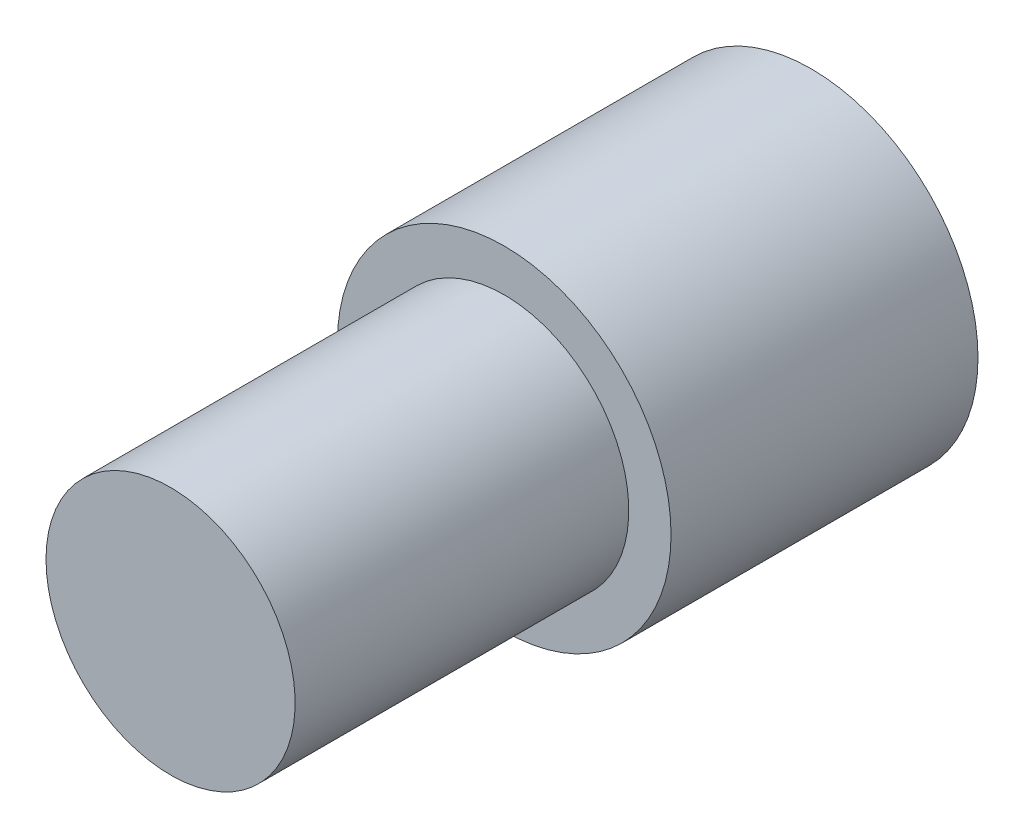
ISO-10303-21;
HEADER;
FILE_DESCRIPTION(('STEP AP214'),'2;1');
FILE_NAME('part.step','',(''),(''),'','','');
FILE_SCHEMA(('AUTOMOTIVE_DESIGN { 1 0 10303 214 1 1 1 1 }'));
ENDSEC;
DATA;
#1=APPLICATION_CONTEXT('core data for automotive mechanical design processes');
#2=APPLICATION_PROTOCOL_DEFINITION('international standard','automotive_design',2000,#1);
#3=PRODUCT_CONTEXT('',#1,'mechanical');
#4=PRODUCT('Part','Part','',(#3));
#5=PRODUCT_RELATED_PRODUCT_CATEGORY('part','',(#4));
#6=PRODUCT_DEFINITION_FORMATION('','',#4);
#7=PRODUCT_DEFINITION_CONTEXT('part definition',#1,'design');
#8=PRODUCT_DEFINITION('design','',#6,#7);
#9=PRODUCT_DEFINITION_SHAPE('','',#8);
#10=(LENGTH_UNIT() NAMED_UNIT(*) SI_UNIT(.MILLI.,.METRE.));
#11=(NAMED_UNIT(*) PLANE_ANGLE_UNIT() SI_UNIT($,.RADIAN.));
#12=(NAMED_UNIT(*) SI_UNIT($,.STERADIAN.) SOLID_ANGLE_UNIT());
#13=UNCERTAINTY_MEASURE_WITH_UNIT(LENGTH_MEASURE(1.E-05),#10,'distance_accuracy_value','');
#14=(GEOMETRIC_REPRESENTATION_CONTEXT(3) GLOBAL_UNCERTAINTY_ASSIGNED_CONTEXT((#13)) GLOBAL_UNIT_ASSIGNED_CONTEXT((#10,
#11,#12)) REPRESENTATION_CONTEXT('',''));
#15=CARTESIAN_POINT('',(0.,0.,0.));
#16=DIRECTION('',(0.,0.,1.));
#17=DIRECTION('',(1.,0.,0.));
#18=AXIS2_PLACEMENT_3D('',#15,#16,#17);
#19=CARTESIAN_POINT('',(0.,0.,17.526));
#20=DIRECTION('',(0.,0.,-1.));
#21=DIRECTION('',(-1.,0.,0.));
#22=AXIS2_PLACEMENT_3D('',#19,#20,#21);
#23=CYLINDRICAL_SURFACE('',#22,9.525);
#24=CARTESIAN_POINT('',(0.,0.,17.526));
#25=DIRECTION('',(0.,0.,1.));
#26=DIRECTION('',(1.,0.,0.));
#27=AXIS2_PLACEMENT_3D('',#24,#25,#26);
#28=CIRCLE('',#27,9.525);
#29=CARTESIAN_POINT('',(9.525,0.,17.526));
#30=VERTEX_POINT('',#29);
#31=EDGE_CURVE('E10',#30,#30,#28,.T.);
#32=ORIENTED_EDGE('',*,*,#31,.F.);
#33=EDGE_LOOP('',(#32));
#34=FACE_BOUND('',#33,.T.);
#35=CARTESIAN_POINT('',(0.,0.,0.));
#36=DIRECTION('',(0.,0.,1.));
#37=DIRECTION('',(1.,0.,0.));
#38=AXIS2_PLACEMENT_3D('',#35,#36,#37);
#39=CIRCLE('',#38,9.525);
#40=CARTESIAN_POINT('',(9.525,0.,0.));
#41=VERTEX_POINT('',#40);
#42=EDGE_CURVE('E33',#41,#41,#39,.T.);
#43=ORIENTED_EDGE('',*,*,#42,.T.);
#44=EDGE_LOOP('',(#43));
#45=FACE_BOUND('',#44,.T.);
#46=ADVANCED_FACE('F30',(#34,#45),#23,.T.);
#47=CARTESIAN_POINT('',(0.,0.,17.526));
#48=DIRECTION('',(0.,0.,1.));
#49=DIRECTION('',(1.,0.,0.));
#50=AXIS2_PLACEMENT_3D('',#47,#48,#49);
#51=PLANE('',#50);
#52=CARTESIAN_POINT('',(0.,0.,17.526));
#53=DIRECTION('',(0.,0.,1.));
#54=DIRECTION('',(1.,0.,0.));
#55=AXIS2_PLACEMENT_3D('',#52,#53,#54);
#56=CIRCLE('',#55,7.112);
#57=CARTESIAN_POINT('',(-7.112,0.,17.526));
#58=VERTEX_POINT('',#57);
#59=EDGE_CURVE('E42',#58,#58,#56,.T.);
#60=ORIENTED_EDGE('',*,*,#59,.F.);
#61=EDGE_LOOP('',(#60));
#62=FACE_BOUND('',#61,.T.);
#63=ORIENTED_EDGE('',*,*,#31,.T.);
#64=EDGE_LOOP('',(#63));
#65=FACE_BOUND('',#64,.T.);
#66=ADVANCED_FACE('F57',(#62,#65),#51,.T.);
#67=CARTESIAN_POINT('',(0.,0.,0.));
#68=DIRECTION('',(0.,0.,1.));
#69=DIRECTION('',(1.,0.,0.));
#70=AXIS2_PLACEMENT_3D('',#67,#68,#69);
#71=PLANE('',#70);
#72=ORIENTED_EDGE('',*,*,#42,.F.);
#73=EDGE_LOOP('',(#72));
#74=FACE_BOUND('',#73,.T.);
#75=ADVANCED_FACE('F53',(#74),#71,.F.);
#76=CARTESIAN_POINT('',(0.,0.,36.576));
#77=DIRECTION('',(0.,0.,-1.));
#78=DIRECTION('',(-1.,0.,0.));
#79=AXIS2_PLACEMENT_3D('',#76,#77,#78);
#80=CYLINDRICAL_SURFACE('',#79,7.112);
#81=CARTESIAN_POINT('',(0.,0.,36.576));
#82=DIRECTION('',(0.,0.,1.));
#83=DIRECTION('',(1.,0.,0.));
#84=AXIS2_PLACEMENT_3D('',#81,#82,#83);
#85=CIRCLE('',#84,7.112);
#86=CARTESIAN_POINT('',(-7.112,0.,36.576));
#87=VERTEX_POINT('',#86);
#88=EDGE_CURVE('E40',#87,#87,#85,.T.);
#89=CARTESIAN_POINT('',(-7.112,0.,36.576));
#90=CARTESIAN_POINT('',(-7.112,0.,36.3775625));
#91=CARTESIAN_POINT('',(-7.112,0.,36.179125));
#92=CARTESIAN_POINT('',(-7.112,0.,35.78225));
#93=CARTESIAN_POINT('',(-7.112,0.,35.5838125));
#94=CARTESIAN_POINT('',(-7.112,0.,35.1869375));
#95=CARTESIAN_POINT('',(-7.112,0.,34.9885));
#96=CARTESIAN_POINT('',(-7.112,0.,34.591625));
#97=CARTESIAN_POINT('',(-7.112,0.,34.3931875));
#98=CARTESIAN_POINT('',(-7.112,0.,33.9963125));
#99=CARTESIAN_POINT('',(-7.112,0.,33.797875));
#100=CARTESIAN_POINT('',(-7.112,0.,33.401));
#101=CARTESIAN_POINT('',(-7.112,0.,33.2025625));
#102=CARTESIAN_POINT('',(-7.112,0.,32.8056875));
#103=CARTESIAN_POINT('',(-7.112,0.,32.60725));
#104=CARTESIAN_POINT('',(-7.112,0.,32.210375));
#105=CARTESIAN_POINT('',(-7.112,0.,32.0119375));
#106=CARTESIAN_POINT('',(-7.112,0.,31.6150625));
#107=CARTESIAN_POINT('',(-7.112,0.,31.416625));
#108=CARTESIAN_POINT('',(-7.112,0.,31.01975));
#109=CARTESIAN_POINT('',(-7.112,0.,30.8213125));
#110=CARTESIAN_POINT('',(-7.112,0.,30.4244375));
#111=CARTESIAN_POINT('',(-7.112,0.,30.226));
#112=CARTESIAN_POINT('',(-7.112,0.,29.829125));
#113=CARTESIAN_POINT('',(-7.112,0.,29.6306875));
#114=CARTESIAN_POINT('',(-7.112,0.,29.2338125));
#115=CARTESIAN_POINT('',(-7.112,0.,29.035375));
#116=CARTESIAN_POINT('',(-7.112,0.,28.6385));
#117=CARTESIAN_POINT('',(-7.112,0.,28.4400625));
#118=CARTESIAN_POINT('',(-7.112,0.,28.0431875));
#119=CARTESIAN_POINT('',(-7.112,0.,27.84475));
#120=CARTESIAN_POINT('',(-7.112,0.,27.447875));
#121=CARTESIAN_POINT('',(-7.112,0.,27.2494375));
#122=CARTESIAN_POINT('',(-7.112,0.,26.8525625));
#123=CARTESIAN_POINT('',(-7.112,0.,26.654125));
#124=CARTESIAN_POINT('',(-7.112,0.,26.25725));
#125=CARTESIAN_POINT('',(-7.112,0.,26.0588125));
#126=CARTESIAN_POINT('',(-7.112,0.,25.6619375));
#127=CARTESIAN_POINT('',(-7.112,0.,25.4635));
#128=CARTESIAN_POINT('',(-7.112,0.,25.066625));
#129=CARTESIAN_POINT('',(-7.112,0.,24.8681875));
#130=CARTESIAN_POINT('',(-7.112,0.,24.4713125));
#131=CARTESIAN_POINT('',(-7.112,0.,24.272875));
#132=CARTESIAN_POINT('',(-7.112,0.,23.876));
#133=CARTESIAN_POINT('',(-7.112,0.,23.6775625));
#134=CARTESIAN_POINT('',(-7.112,0.,23.2806875));
#135=CARTESIAN_POINT('',(-7.112,0.,23.08225));
#136=CARTESIAN_POINT('',(-7.112,0.,22.685375));
#137=CARTESIAN_POINT('',(-7.112,0.,22.4869375));
#138=CARTESIAN_POINT('',(-7.112,0.,22.0900625));
#139=CARTESIAN_POINT('',(-7.112,0.,21.891625));
#140=CARTESIAN_POINT('',(-7.112,0.,21.49475));
#141=CARTESIAN_POINT('',(-7.112,0.,21.2963125));
#142=CARTESIAN_POINT('',(-7.112,0.,20.8994375));
#143=CARTESIAN_POINT('',(-7.112,0.,20.701));
#144=CARTESIAN_POINT('',(-7.112,0.,20.304125));
#145=CARTESIAN_POINT('',(-7.112,0.,20.1056875));
#146=CARTESIAN_POINT('',(-7.112,0.,19.7088125));
#147=CARTESIAN_POINT('',(-7.112,0.,19.510375));
#148=CARTESIAN_POINT('',(-7.112,0.,19.1135));
#149=CARTESIAN_POINT('',(-7.112,0.,18.9150625));
#150=CARTESIAN_POINT('',(-7.112,0.,18.5181875));
#151=CARTESIAN_POINT('',(-7.112,0.,18.31975));
#152=CARTESIAN_POINT('',(-7.112,0.,17.922875));
#153=CARTESIAN_POINT('',(-7.112,0.,17.7244375));
#154=CARTESIAN_POINT('',(-7.112,0.,17.526));
#155=B_SPLINE_CURVE_WITH_KNOTS('',3,(#89,#90,#91,#92,#93,#94,#95,#96,#97,#98,#99,#100,#101,#102,
#103,#104,#105,#106,#107,#108,#109,#110,#111,#112,#113,#114,#115,#116,#117,#118,#119,#120,#121,
#122,#123,#124,#125,#126,#127,#128,#129,#130,#131,#132,#133,#134,#135,#136,#137,#138,#139,#140,
#141,#142,#143,#144,#145,#146,#147,#148,#149,#150,#151,#152,#153,#154),.UNSPECIFIED.,.F.,.F.,(4,
2,2,2,2,2,2,2,2,2,2,2,2,2,2,2,2,2,2,2,2,2,2,2,2,2,2,2,2,2,2,2,4),(0.,0.5953125,1.190625,
1.7859375,2.38125,2.9765625,3.571875,4.1671875,4.7625,5.3578125,5.953125,6.5484375,7.14375,
7.7390625,8.334375,8.9296875,9.525,10.1203125,10.715625,11.3109375,11.90625,12.5015625,
13.096875,13.6921875,14.2875,14.8828125,15.478125,16.0734375,16.66875,17.2640625,17.859375,
18.4546875,19.05),.UNSPECIFIED.);
#156=EDGE_CURVE('BSEAM50',#87,#58,#155,.T.);
#157=ORIENTED_EDGE('',*,*,#88,.F.);
#158=ORIENTED_EDGE('',*,*,#59,.T.);
#159=ORIENTED_EDGE('',*,*,#156,.T.);
#160=ORIENTED_EDGE('',*,*,#156,.F.);
#161=EDGE_LOOP('',(#157,#159,#158,#160));
#162=FACE_BOUND('',#161,.T.);
#163=ADVANCED_FACE('F50',(#162),#80,.T.);
#164=CARTESIAN_POINT('',(0.,0.,36.576));
#165=DIRECTION('',(0.,0.,1.));
#166=DIRECTION('',(1.,0.,0.));
#167=AXIS2_PLACEMENT_3D('',#164,#165,#166);
#168=PLANE('',#167);
#169=ORIENTED_EDGE('',*,*,#88,.T.);
#170=EDGE_LOOP('',(#169));
#171=FACE_BOUND('',#170,.T.);
#172=ADVANCED_FACE('F48',(#171),#168,.T.);
#173=CLOSED_SHELL('',(#46,#66,#75,#163,#172));
#174=MANIFOLD_SOLID_BREP('B2',#173);
#175=ADVANCED_BREP_SHAPE_REPRESENTATION('',(#18,#174),#14);
#176=SHAPE_DEFINITION_REPRESENTATION(#9,#175);
ENDSEC;
END-ISO-10303-21;
